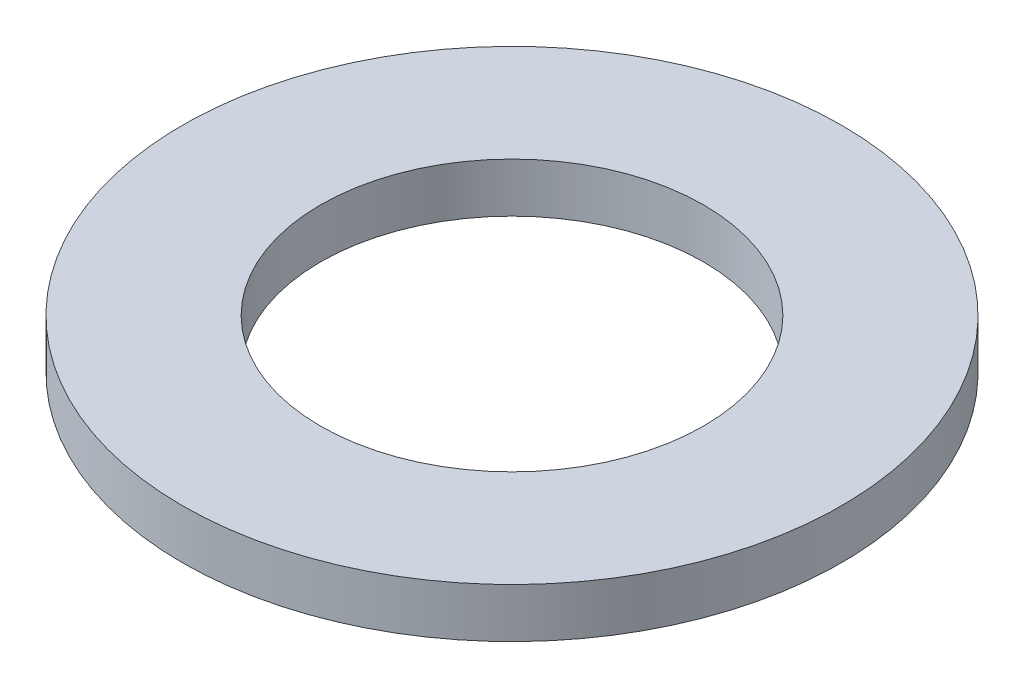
from build123d import *

# Parameters (mm, degrees)
SKETCH1_R      = 80
SKETCH1_R_2    = 46.5
EXTRUDE1_DEPTH = 12


with BuildPart() as part:
    # Sketch1 → Extrude1 (new body)
    with BuildSketch(Plane(origin=(0, 0, 0), x_dir=(1, 0, 0), z_dir=(0, 1, 0))):
        with Locations(Location((0, 0, 0), (0, 0, 270))):
            Circle(SKETCH1_R)
        with Locations(Location((0, 0, 0), (0, 0, 270))):
            Circle(SKETCH1_R_2, mode=Mode.SUBTRACT)
    extrude(amount=EXTRUDE1_DEPTH)


solid = part.part
